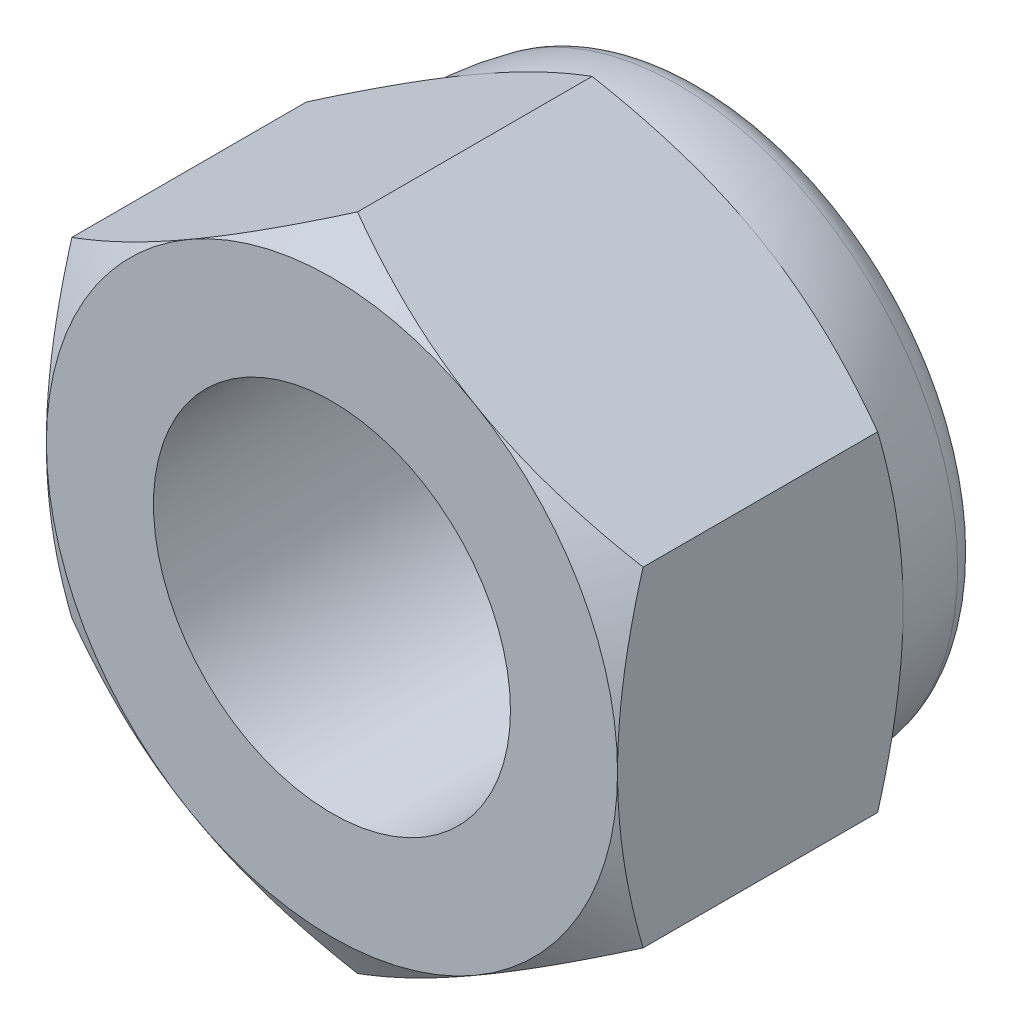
from build123d import *

# Parameters (mm, degrees)
BASE_EXTRUSION_DEPTH    = 8
ENL_V_MAT_EXTRU_2_DEPTH = 17.111590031
CONG_1_R                = 1
ESQUISSE3_R             = 5
ENL_V_MAT_EXTRU_1_DEPTH = 17.111590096
ESQUISSE6_W             = 0.7
ESQUISSE6_H             = 1.5


with BuildPart() as part:
    # Esquisse1 → Base-Extrusion (new body)
    with BuildSketch(Plane.XY):
        Polygon((8, -4.618802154), (8, 4.618802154), (0, 9.237604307), (-8, 4.618802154), (-8, -4.618802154), (0, -9.237604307), align=None)
    extrude(amount=-BASE_EXTRUSION_DEPTH)

    # Esquisse2 → Enl_vement de mati_re-R_volution1 (revolve, cut)
    with BuildSketch(Plane(origin=(0, 0, 0), x_dir=(1, 0, 0), z_dir=(0, 1, 0))):
        Polygon((-8, 0), (-15.92820323, 0), (-15.92820323, 8), (-8, 8), (-14.92820323, 4), align=None)
    revolve(axis=Axis((0, 0, -8), (0, 0, 1)), mode=Mode.SUBTRACT)

    # Esquisse4 → Boss.-R_vol.1 (revolve)
    with BuildSketch(Plane(origin=(0, 0, 0), x_dir=(1, 0, 0), z_dir=(0, 1, 0))):
        with BuildLine():
            Line((0, 16), (0, 8))
            Line((0, 8), (-8, 8))
            ThreePointArc((-8, 8), (-5.656854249, 13.656854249), (0, 16))
        make_face()
    revolve(axis=Axis((0, 0, 0), (0, 0, -1)))

    # Esquisse5 → Enl_v. mat.-Extru.2 (cut, through all)
    with BuildSketch(Plane.XY.offset(-10.5)):
        with BuildLine():
            ThreePointArc((8, 0), (6.92820323, 4), (4, 6.92820323))
            ThreePointArc((4, 6.92820323), (0, 8), (-4, 6.92820323))
            ThreePointArc((-4, 6.92820323), (-6.92820323, 4), (-8, 0))
            ThreePointArc((-8, 0), (-6.92820323, -4), (-4, -6.92820323))
            ThreePointArc((-4, -6.92820323), (0, -8), (4, -6.92820323))
            ThreePointArc((4, -6.92820323), (6.92820323, -4), (8, 0))
        make_face()
    extrude(amount=-ENL_V_MAT_EXTRU_2_DEPTH, mode=Mode.SUBTRACT)

    # Cong_1
    cong_1_edges = [part.edges().sort_by_distance(p)[0] for p in [
        (7.599342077, 0, -10.5),
    ]]
    fillet(cong_1_edges, radius=CONG_1_R)

    # Esquisse3 → Enl_v. mat.-Extru.1 (cut, through all)
    with BuildSketch(Plane.XY):
        Circle(ESQUISSE3_R)
    extrude(amount=-ENL_V_MAT_EXTRU_1_DEPTH, mode=Mode.SUBTRACT)

    # Esquisse6 → R_volution2 (revolve)
    with BuildSketch(Plane(origin=(0, 0, 0), x_dir=(1, 0, 0), z_dir=(0, 1, 0))):
        with Locations((4.65, 9.85)):
            Rectangle(ESQUISSE6_W, ESQUISSE6_H)
    revolve(axis=Axis((0, 0, -50), (0, 0, 1)))


solid = part.part
